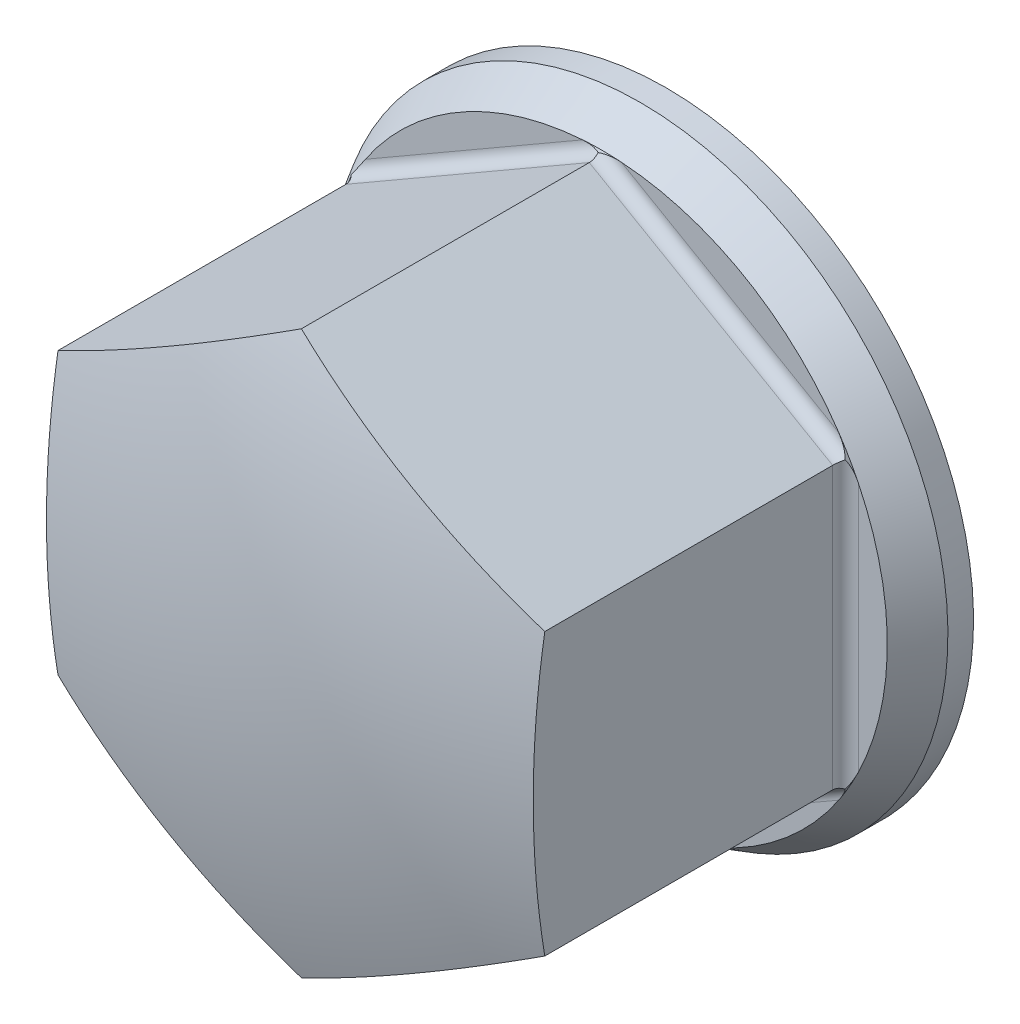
ISO-10303-21;
HEADER;
FILE_DESCRIPTION(('STEP AP214'),'2;1');
FILE_NAME('part.step','',(''),(''),'','','');
FILE_SCHEMA(('AUTOMOTIVE_DESIGN { 1 0 10303 214 1 1 1 1 }'));
ENDSEC;
DATA;
#1=APPLICATION_CONTEXT('core data for automotive mechanical design processes');
#2=APPLICATION_PROTOCOL_DEFINITION('international standard','automotive_design',2000,#1);
#3=PRODUCT_CONTEXT('',#1,'mechanical');
#4=PRODUCT('Part','Part','',(#3));
#5=PRODUCT_RELATED_PRODUCT_CATEGORY('part','',(#4));
#6=PRODUCT_DEFINITION_FORMATION('','',#4);
#7=PRODUCT_DEFINITION_CONTEXT('part definition',#1,'design');
#8=PRODUCT_DEFINITION('design','',#6,#7);
#9=PRODUCT_DEFINITION_SHAPE('','',#8);
#10=(LENGTH_UNIT() NAMED_UNIT(*) SI_UNIT(.MILLI.,.METRE.));
#11=(NAMED_UNIT(*) PLANE_ANGLE_UNIT() SI_UNIT($,.RADIAN.));
#12=(NAMED_UNIT(*) SI_UNIT($,.STERADIAN.) SOLID_ANGLE_UNIT());
#13=UNCERTAINTY_MEASURE_WITH_UNIT(LENGTH_MEASURE(1.E-05),#10,'distance_accuracy_value','');
#14=(GEOMETRIC_REPRESENTATION_CONTEXT(3) GLOBAL_UNCERTAINTY_ASSIGNED_CONTEXT((#13)) GLOBAL_UNIT_ASSIGNED_CONTEXT((#10,
#11,#12)) REPRESENTATION_CONTEXT('',''));
#15=CARTESIAN_POINT('',(0.,0.,0.));
#16=DIRECTION('',(0.,0.,1.));
#17=DIRECTION('',(1.,0.,0.));
#18=AXIS2_PLACEMENT_3D('',#15,#16,#17);
#19=CARTESIAN_POINT('',(0.,0.,0.));
#20=DIRECTION('',(0.,0.,-1.));
#21=DIRECTION('',(0.,1.,0.));
#22=AXIS2_PLACEMENT_3D('',#19,#20,#21);
#23=CYLINDRICAL_SURFACE('',#22,12.);
#24=CARTESIAN_POINT('',(0.,0.,0.));
#25=DIRECTION('',(0.,0.,-1.));
#26=DIRECTION('',(0.,1.,0.));
#27=AXIS2_PLACEMENT_3D('',#24,#25,#26);
#28=CIRCLE('',#27,12.);
#29=CARTESIAN_POINT('',(0.,12.,0.));
#30=VERTEX_POINT('',#29);
#31=EDGE_CURVE('E175',#30,#30,#28,.T.);
#32=ORIENTED_EDGE('',*,*,#31,.F.);
#33=EDGE_LOOP('',(#32));
#34=FACE_BOUND('',#33,.T.);
#35=CARTESIAN_POINT('',(0.,0.,1.));
#36=DIRECTION('',(0.,0.,-1.));
#37=DIRECTION('',(0.,1.,0.));
#38=AXIS2_PLACEMENT_3D('',#35,#36,#37);
#39=CIRCLE('',#38,12.);
#40=CARTESIAN_POINT('',(0.,12.,1.));
#41=VERTEX_POINT('',#40);
#42=EDGE_CURVE('E140',#41,#41,#39,.T.);
#43=ORIENTED_EDGE('',*,*,#42,.T.);
#44=EDGE_LOOP('',(#43));
#45=FACE_BOUND('',#44,.T.);
#46=ADVANCED_FACE('F14',(#34,#45),#23,.T.);
#47=CARTESIAN_POINT('',(12.,0.,0.));
#48=DIRECTION('',(0.,0.,1.));
#49=DIRECTION('',(0.,-1.,0.));
#50=AXIS2_PLACEMENT_3D('',#47,#48,#49);
#51=PLANE('',#50);
#52=CARTESIAN_POINT('',(0.,0.,0.));
#53=DIRECTION('',(0.,0.,-1.));
#54=DIRECTION('',(0.,1.,0.));
#55=AXIS2_PLACEMENT_3D('',#52,#53,#54);
#56=CIRCLE('',#55,6.);
#57=CARTESIAN_POINT('',(0.,6.,0.));
#58=VERTEX_POINT('',#57);
#59=EDGE_CURVE('E323',#58,#58,#56,.T.);
#60=ORIENTED_EDGE('',*,*,#59,.F.);
#61=EDGE_LOOP('',(#60));
#62=FACE_BOUND('',#61,.T.);
#63=ORIENTED_EDGE('',*,*,#31,.T.);
#64=EDGE_LOOP('',(#63));
#65=FACE_BOUND('',#64,.T.);
#66=ADVANCED_FACE('F307',(#62,#65),#51,.F.);
#67=CARTESIAN_POINT('',(0.,0.,1.));
#68=DIRECTION('',(0.,0.,-1.));
#69=DIRECTION('',(0.,1.,0.));
#70=AXIS2_PLACEMENT_3D('',#67,#68,#69);
#71=CYLINDRICAL_SURFACE('',#70,11.1339745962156);
#72=CARTESIAN_POINT('',(-9.5,-5.80649552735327,3.));
#73=CARTESIAN_POINT('',(-9.49997954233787,-5.80652729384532,2.98433882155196));
#74=CARTESIAN_POINT('',(-9.50073467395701,-5.80529359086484,2.9687192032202));
#75=CARTESIAN_POINT('',(-9.5036170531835,-5.80057460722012,2.93808940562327));
#76=CARTESIAN_POINT('',(-9.50573215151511,-5.7971092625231,2.92307506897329));
#77=CARTESIAN_POINT('',(-9.51115280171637,-5.78821110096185,2.89393642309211));
#78=CARTESIAN_POINT('',(-9.51445475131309,-5.7827842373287,2.87980957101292));
#79=CARTESIAN_POINT('',(-9.5220274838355,-5.7703064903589,2.85254604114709));
#80=CARTESIAN_POINT('',(-9.526300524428,-5.76325182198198,2.83941176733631));
#81=CARTESIAN_POINT('',(-9.53882878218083,-5.74250508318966,2.80547647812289));
#82=CARTESIAN_POINT('',(-9.54779029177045,-5.72760328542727,2.78567682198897));
#83=CARTESIAN_POINT('',(-9.56707894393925,-5.695326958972,2.74898079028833));
#84=CARTESIAN_POINT('',(-9.57740988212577,-5.67794554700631,2.73209279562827));
#85=CARTESIAN_POINT('',(-9.60675156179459,-5.62823581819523,2.68945845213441));
#86=CARTESIAN_POINT('',(-9.62659679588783,-5.59425296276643,2.66623624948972));
#87=CARTESIAN_POINT('',(-9.66732473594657,-5.52357745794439,2.62563015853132));
#88=CARTESIAN_POINT('',(-9.68821006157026,-5.48687783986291,2.60826196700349));
#89=CARTESIAN_POINT('',(-9.72963925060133,-5.41306213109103,2.57865660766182));
#90=CARTESIAN_POINT('',(-9.75017213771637,-5.37599837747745,2.56627097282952));
#91=CARTESIAN_POINT('',(-9.79123466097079,-5.30084486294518,2.5450827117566));
#92=CARTESIAN_POINT('',(-9.81176427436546,-5.26275413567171,2.53628359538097));
#93=CARTESIAN_POINT('',(-9.87302770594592,-5.14745194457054,2.51444151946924));
#94=CARTESIAN_POINT('',(-9.913451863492,-5.06918248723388,2.50594374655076));
#95=CARTESIAN_POINT('',(-9.96088366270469,-4.97458577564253,2.50147038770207));
#96=CARTESIAN_POINT('',(-9.96876859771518,-4.95876574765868,2.50091509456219));
#97=CARTESIAN_POINT('',(-9.98444726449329,-4.92712005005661,2.50017988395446));
#98=CARTESIAN_POINT('',(-9.99224117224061,-4.91129448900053,2.49999905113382));
#99=CARTESIAN_POINT('',(-10.,-4.89544587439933,2.5));
#100=B_SPLINE_CURVE_WITH_KNOTS('',3,(#72,#73,#74,#75,#76,#77,#78,#79,#80,#81,#82,#83,#84,#85,
#86,#87,#88,#89,#90,#91,#92,#93,#94,#95,#96,#97,#98,#99),.UNSPECIFIED.,.F.,.F.,(4,2,2,2,2,2,2,2,
2,2,2,2,2,4),(0.,0.0468508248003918,0.0932888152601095,0.139587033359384,0.185994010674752,
0.264590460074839,0.343409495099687,0.479722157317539,0.616397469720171,0.748628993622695,
0.880989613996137,1.14561083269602,1.19866671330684,1.2515927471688),.UNSPECIFIED.);
#101=CARTESIAN_POINT('',(-9.64230484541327,-5.56698729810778,2.6506374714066));
#102=VERTEX_POINT('',#101);
#103=CARTESIAN_POINT('',(-10.,-4.89544587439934,2.5));
#104=VERTEX_POINT('',#103);
#105=EDGE_CURVE('E270',#102,#104,#100,.T.);
#106=ORIENTED_EDGE('',*,*,#105,.T.);
#107=CARTESIAN_POINT('',(0.,0.,2.5));
#108=DIRECTION('',(0.,0.,-1.));
#109=DIRECTION('',(0.,1.,0.));
#110=AXIS2_PLACEMENT_3D('',#107,#108,#109);
#111=CIRCLE('',#110,11.1339745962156);
#112=CARTESIAN_POINT('',(-9.23958049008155,-6.21253110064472,2.5));
#113=VERTEX_POINT('',#112);
#114=EDGE_CURVE('E569',#113,#104,#111,.T.);
#115=ORIENTED_EDGE('',*,*,#114,.F.);
#116=CARTESIAN_POINT('',(-9.23958049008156,-6.21253110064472,2.5));
#117=CARTESIAN_POINT('',(-9.25538522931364,-6.18902561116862,2.50000180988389));
#118=CARTESIAN_POINT('',(-9.27109903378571,-6.16546137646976,2.50046507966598));
#119=CARTESIAN_POINT('',(-9.3023332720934,-6.11823406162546,2.50237335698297));
#120=CARTESIAN_POINT('',(-9.31785364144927,-6.09457095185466,2.50381868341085));
#121=CARTESIAN_POINT('',(-9.36433905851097,-6.02310446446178,2.50974711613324));
#122=CARTESIAN_POINT('',(-9.39497443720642,-5.97520165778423,2.51582466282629));
#123=CARTESIAN_POINT('',(-9.45561653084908,-5.87877583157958,2.53306733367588));
#124=CARTESIAN_POINT('',(-9.48560469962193,-5.83025552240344,2.54431424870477));
#125=CARTESIAN_POINT('',(-9.54395150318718,-5.73423980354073,2.57305937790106));
#126=CARTESIAN_POINT('',(-9.57231597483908,-5.68674116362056,2.59053332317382));
#127=CARTESIAN_POINT('',(-9.61305359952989,-5.61741152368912,2.62280833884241));
#128=CARTESIAN_POINT('',(-9.62630420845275,-5.5946691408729,2.63454503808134));
#129=CARTESIAN_POINT('',(-9.65205712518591,-5.55012092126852,2.66039532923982));
#130=CARTESIAN_POINT('',(-9.66455977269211,-5.52831466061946,2.67450783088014));
#131=CARTESIAN_POINT('',(-9.6886666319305,-5.48595739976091,2.70567640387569));
#132=CARTESIAN_POINT('',(-9.70026134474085,-5.46542005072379,2.72275877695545));
#133=CARTESIAN_POINT('',(-9.72195485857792,-5.42673671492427,2.76027770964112));
#134=CARTESIAN_POINT('',(-9.73205731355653,-5.40858489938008,2.78070580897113));
#135=CARTESIAN_POINT('',(-9.74648722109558,-5.38251857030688,2.81653953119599));
#136=CARTESIAN_POINT('',(-9.75152440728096,-5.37338344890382,2.83076629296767));
#137=CARTESIAN_POINT('',(-9.76053012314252,-5.35700746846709,2.86060196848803));
#138=CARTESIAN_POINT('',(-9.76449934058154,-5.34976539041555,2.87620998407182));
#139=CARTESIAN_POINT('',(-9.77070621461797,-5.33841994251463,2.9067166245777));
#140=CARTESIAN_POINT('',(-9.77309230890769,-5.33404815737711,2.92148392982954));
#141=CARTESIAN_POINT('',(-9.77663298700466,-5.32755594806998,2.95163038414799));
#142=CARTESIAN_POINT('',(-9.77779072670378,-5.32542975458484,2.96700785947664));
#143=CARTESIAN_POINT('',(-9.77847934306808,-5.32416485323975,2.98830152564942));
#144=CARTESIAN_POINT('',(-9.77857424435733,-5.32399047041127,2.9941519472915));
#145=CARTESIAN_POINT('',(-9.77857263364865,-5.32399357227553,3.));
#146=B_SPLINE_CURVE_WITH_KNOTS('',3,(#116,#117,#118,#119,#120,#121,#122,#123,#124,#125,#126,
#127,#128,#129,#130,#131,#132,#133,#134,#135,#136,#137,#138,#139,#140,#141,#142,#143,#144,#145),
.UNSPECIFIED.,.F.,.F.,(4,2,2,2,2,2,2,2,2,2,2,2,2,2,4),(0.,0.0849655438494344,0.169958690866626,
0.341307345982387,0.51546574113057,0.688952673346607,0.775318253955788,0.861644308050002,
0.948777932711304,1.03569453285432,1.08847186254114,1.14121512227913,1.1877756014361,
1.23421616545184,1.25176402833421),.UNSPECIFIED.);
#147=EDGE_CURVE('E265',#113,#102,#146,.T.);
#148=ORIENTED_EDGE('',*,*,#147,.T.);
#149=EDGE_LOOP('',(#106,#115,#148));
#150=FACE_BOUND('',#149,.T.);
#151=ADVANCED_FACE('F199',(#150),#71,.T.);
#152=CARTESIAN_POINT('',(9.5,5.80649552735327,3.));
#153=CARTESIAN_POINT('',(9.49997954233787,5.80652729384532,2.98433882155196));
#154=CARTESIAN_POINT('',(9.50073467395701,5.80529359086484,2.9687192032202));
#155=CARTESIAN_POINT('',(9.5036170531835,5.80057460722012,2.93808940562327));
#156=CARTESIAN_POINT('',(9.50573215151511,5.7971092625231,2.92307506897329));
#157=CARTESIAN_POINT('',(9.51115280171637,5.78821110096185,2.89393642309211));
#158=CARTESIAN_POINT('',(9.51445475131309,5.78278423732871,2.87980957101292));
#159=CARTESIAN_POINT('',(9.5220274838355,5.7703064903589,2.85254604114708));
#160=CARTESIAN_POINT('',(9.526300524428,5.76325182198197,2.83941176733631));
#161=CARTESIAN_POINT('',(9.53882878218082,5.74250508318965,2.80547647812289));
#162=CARTESIAN_POINT('',(9.54779029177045,5.72760328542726,2.78567682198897));
#163=CARTESIAN_POINT('',(9.56707894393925,5.695326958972,2.74898079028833));
#164=CARTESIAN_POINT('',(9.57740988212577,5.67794554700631,2.73209279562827));
#165=CARTESIAN_POINT('',(9.60675156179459,5.62823581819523,2.68945845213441));
#166=CARTESIAN_POINT('',(9.62659679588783,5.59425296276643,2.66623624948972));
#167=CARTESIAN_POINT('',(9.66732473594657,5.5235774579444,2.62563015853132));
#168=CARTESIAN_POINT('',(9.68821006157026,5.48687783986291,2.60826196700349));
#169=CARTESIAN_POINT('',(9.72963925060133,5.41306213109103,2.57865660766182));
#170=CARTESIAN_POINT('',(9.75017213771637,5.37599837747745,2.56627097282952));
#171=CARTESIAN_POINT('',(9.79123466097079,5.30084486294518,2.5450827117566));
#172=CARTESIAN_POINT('',(9.81176427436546,5.26275413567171,2.53628359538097));
#173=CARTESIAN_POINT('',(9.87302770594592,5.14745194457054,2.51444151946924));
#174=CARTESIAN_POINT('',(9.913451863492,5.06918248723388,2.50594374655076));
#175=CARTESIAN_POINT('',(9.96088366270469,4.97458577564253,2.50147038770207));
#176=CARTESIAN_POINT('',(9.96876859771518,4.95876574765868,2.50091509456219));
#177=CARTESIAN_POINT('',(9.98444726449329,4.9271200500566,2.50017988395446));
#178=CARTESIAN_POINT('',(9.99224117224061,4.91129448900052,2.49999905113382));
#179=CARTESIAN_POINT('',(10.,4.89544587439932,2.5));
#180=B_SPLINE_CURVE_WITH_KNOTS('',3,(#152,#153,#154,#155,#156,#157,#158,#159,#160,#161,#162,
#163,#164,#165,#166,#167,#168,#169,#170,#171,#172,#173,#174,#175,#176,#177,#178,#179),
.UNSPECIFIED.,.F.,.F.,(4,2,2,2,2,2,2,2,2,2,2,2,2,4),(0.,0.0468508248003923,0.0932888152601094,
0.139587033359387,0.185994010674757,0.264590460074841,0.343409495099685,0.479722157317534,
0.61639746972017,0.748628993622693,0.880989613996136,1.14561083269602,1.19866671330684,
1.25159274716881),.UNSPECIFIED.);
#181=CARTESIAN_POINT('',(9.64230484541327,5.56698729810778,2.6506374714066));
#182=VERTEX_POINT('',#181);
#183=CARTESIAN_POINT('',(10.,4.89544587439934,2.5));
#184=VERTEX_POINT('',#183);
#185=EDGE_CURVE('E259',#182,#184,#180,.T.);
#186=ORIENTED_EDGE('',*,*,#185,.T.);
#187=CARTESIAN_POINT('',(9.23958049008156,6.21253110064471,2.5));
#188=VERTEX_POINT('',#187);
#189=EDGE_CURVE('E136',#188,#184,#111,.T.);
#190=ORIENTED_EDGE('',*,*,#189,.F.);
#191=CARTESIAN_POINT('',(9.23958049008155,6.21253110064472,2.5));
#192=CARTESIAN_POINT('',(9.25538522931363,6.18902561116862,2.50000180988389));
#193=CARTESIAN_POINT('',(9.27109903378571,6.16546137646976,2.50046507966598));
#194=CARTESIAN_POINT('',(9.3023332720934,6.11823406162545,2.50237335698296));
#195=CARTESIAN_POINT('',(9.31785364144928,6.09457095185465,2.50381868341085));
#196=CARTESIAN_POINT('',(9.36433905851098,6.02310446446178,2.50974711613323));
#197=CARTESIAN_POINT('',(9.39497443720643,5.97520165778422,2.51582466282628));
#198=CARTESIAN_POINT('',(9.45561653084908,5.87877583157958,2.53306733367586));
#199=CARTESIAN_POINT('',(9.48560469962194,5.83025552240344,2.54431424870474));
#200=CARTESIAN_POINT('',(9.54395150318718,5.73423980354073,2.57305937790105));
#201=CARTESIAN_POINT('',(9.57231597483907,5.68674116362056,2.59053332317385));
#202=CARTESIAN_POINT('',(9.61305359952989,5.61741152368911,2.6228083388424));
#203=CARTESIAN_POINT('',(9.62630420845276,5.59466914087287,2.6345450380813));
#204=CARTESIAN_POINT('',(9.65205712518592,5.5501209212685,2.66039532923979));
#205=CARTESIAN_POINT('',(9.66455977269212,5.52831466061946,2.67450783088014));
#206=CARTESIAN_POINT('',(9.68866663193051,5.48595739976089,2.70567640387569));
#207=CARTESIAN_POINT('',(9.70026134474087,5.46542005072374,2.72275877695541));
#208=CARTESIAN_POINT('',(9.72195485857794,5.42673671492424,2.76027770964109));
#209=CARTESIAN_POINT('',(9.73205731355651,5.4085848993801,2.78070580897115));
#210=CARTESIAN_POINT('',(9.74648722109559,5.38251857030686,2.81653953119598));
#211=CARTESIAN_POINT('',(9.751524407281,5.37338344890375,2.83076629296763));
#212=CARTESIAN_POINT('',(9.76053012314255,5.35700746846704,2.860601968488));
#213=CARTESIAN_POINT('',(9.76449934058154,5.34976539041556,2.87620998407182));
#214=CARTESIAN_POINT('',(9.77070621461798,5.33841994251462,2.90671662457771));
#215=CARTESIAN_POINT('',(9.77309230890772,5.33404815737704,2.92148392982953));
#216=CARTESIAN_POINT('',(9.7766329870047,5.3275559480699,2.95163038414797));
#217=CARTESIAN_POINT('',(9.77779072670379,5.32542975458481,2.96700785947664));
#218=CARTESIAN_POINT('',(9.77847934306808,5.32416485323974,2.98830152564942));
#219=CARTESIAN_POINT('',(9.77857424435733,5.32399047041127,2.99415194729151));
#220=CARTESIAN_POINT('',(9.77857263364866,5.32399357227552,3.));
#221=B_SPLINE_CURVE_WITH_KNOTS('',3,(#191,#192,#193,#194,#195,#196,#197,#198,#199,#200,#201,
#202,#203,#204,#205,#206,#207,#208,#209,#210,#211,#212,#213,#214,#215,#216,#217,#218,#219,#220),
.UNSPECIFIED.,.F.,.F.,(4,2,2,2,2,2,2,2,2,2,2,2,2,2,4),(0.,0.084965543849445,0.169958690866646,
0.341307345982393,0.515465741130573,0.688952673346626,0.775318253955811,0.861644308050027,
0.948777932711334,1.03569453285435,1.08847186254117,1.14121512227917,1.18777560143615,
1.23421616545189,1.25176402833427),.UNSPECIFIED.);
#222=EDGE_CURVE('E253',#188,#182,#221,.T.);
#223=ORIENTED_EDGE('',*,*,#222,.T.);
#224=EDGE_LOOP('',(#186,#190,#223));
#225=FACE_BOUND('',#224,.T.);
#226=ADVANCED_FACE('F479',(#225),#71,.T.);
#227=CARTESIAN_POINT('',(-10.,4.89544587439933,2.5));
#228=CARTESIAN_POINT('',(-9.98754601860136,4.92088592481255,2.50000180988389));
#229=CARTESIAN_POINT('',(-9.97499569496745,4.9462765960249,2.50046507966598));
#230=CARTESIAN_POINT('',(-9.94971275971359,4.99693989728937,2.50237335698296));
#231=CARTESIAN_POINT('',(-9.93698009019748,5.02221248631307,2.50381868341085));
#232=CARTESIAN_POINT('',(-9.89833100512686,5.09820328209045,2.50974711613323));
#233=CARTESIAN_POINT('',(-9.87216364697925,5.14868570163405,2.51582466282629));
#234=CARTESIAN_POINT('',(-9.81897747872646,5.24941620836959,2.53306733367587));
#235=CARTESIAN_POINT('',(-9.79195174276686,5.29964687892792,2.54431424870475));
#236=CARTESIAN_POINT('',(-9.73797309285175,5.3981845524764,2.57305937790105));
#237=CARTESIAN_POINT('',(-9.71102029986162,5.44649822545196,2.59053332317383));
#238=CARTESIAN_POINT('',(-9.67134788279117,5.51644286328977,2.6228083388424));
#239=CARTESIAN_POINT('',(-9.65827770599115,5.53928941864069,2.63454503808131));
#240=CARTESIAN_POINT('',(-9.63257427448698,5.58386620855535,2.6603953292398));
#241=CARTESIAN_POINT('',(-9.61994082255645,5.6055969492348,2.67450783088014));
#242=CARTESIAN_POINT('',(-9.59531178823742,5.64765273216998,2.70567640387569));
#243=CARTESIAN_POINT('',(-9.58332327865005,5.6679627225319,2.72275877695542));
#244=CARTESIAN_POINT('',(-9.56066928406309,5.7060915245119,2.7602777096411));
#245=CARTESIAN_POINT('',(-9.55000057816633,5.72391641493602,2.78070580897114));
#246=CARTESIAN_POINT('',(-9.53464142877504,5.74944624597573,2.81653953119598));
#247=CARTESIAN_POINT('',(-9.52924877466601,5.75837613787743,2.83076629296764));
#248=CARTESIAN_POINT('',(-9.51956961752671,5.77436330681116,2.860601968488));
#249=CARTESIAN_POINT('',(-9.51528240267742,5.78142178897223,2.87620998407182));
#250=CARTESIAN_POINT('',(-9.50856039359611,5.79246982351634,2.9067166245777));
#251=CARTESIAN_POINT('',(-9.50596736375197,5.79672213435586,2.92148392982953));
#252=CARTESIAN_POINT('',(-9.50211528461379,5.80303455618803,2.95163038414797));
#253=CARTESIAN_POINT('',(-9.50085281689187,5.80510028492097,2.96700785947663));
#254=CARTESIAN_POINT('',(-9.50010168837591,5.80632909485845,2.98830152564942));
#255=CARTESIAN_POINT('',(-9.49999811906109,5.80649847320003,2.99415194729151));
#256=CARTESIAN_POINT('',(-9.5,5.80649552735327,3.));
#257=B_SPLINE_CURVE_WITH_KNOTS('',3,(#227,#228,#229,#230,#231,#232,#233,#234,#235,#236,#237,
#238,#239,#240,#241,#242,#243,#244,#245,#246,#247,#248,#249,#250,#251,#252,#253,#254,#255,#256),
.UNSPECIFIED.,.F.,.F.,(4,2,2,2,2,2,2,2,2,2,2,2,2,2,4),(0.,0.0849655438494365,0.16995869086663,
0.341307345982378,0.515465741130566,0.68895267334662,0.775318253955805,0.861644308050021,
0.948777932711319,1.03569453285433,1.08847186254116,1.14121512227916,1.18777560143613,
1.23421616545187,1.25176402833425),.UNSPECIFIED.);
#258=CARTESIAN_POINT('',(-10.,4.89544587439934,2.5));
#259=VERTEX_POINT('',#258);
#260=CARTESIAN_POINT('',(-9.64230484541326,5.56698729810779,2.6506374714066));
#261=VERTEX_POINT('',#260);
#262=EDGE_CURVE('E245',#259,#261,#257,.T.);
#263=ORIENTED_EDGE('',*,*,#262,.T.);
#264=CARTESIAN_POINT('',(-9.77857263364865,5.32399357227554,3.));
#265=CARTESIAN_POINT('',(-9.77858991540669,5.3239599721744,2.98433882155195));
#266=CARTESIAN_POINT('',(-9.77789906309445,5.32523078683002,2.9687192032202));
#267=CARTESIAN_POINT('',(-9.77525349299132,5.33008649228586,2.93808940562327));
#268=CARTESIAN_POINT('',(-9.77330996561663,5.33365089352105,2.92307506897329));
#269=CARTESIAN_POINT('',(-9.76831425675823,5.342794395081,2.8939364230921));
#270=CARTESIAN_POINT('',(-9.76526542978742,5.34836739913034,2.87980957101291));
#271=CARTESIAN_POINT('',(-9.75824575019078,5.36116445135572,2.85254604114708));
#272=CARTESIAN_POINT('',(-9.75427274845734,5.36839234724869,2.8394117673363));
#273=CARTESIAN_POINT('',(-9.74256967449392,5.38961550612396,2.80547647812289));
#274=CARTESIAN_POINT('',(-9.73414509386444,5.40482729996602,2.78567682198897));
#275=CARTESIAN_POINT('',(-9.71583730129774,5.43766992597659,2.74898079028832));
#276=CARTESIAN_POINT('',(-9.70595002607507,5.4553074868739,2.73209279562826));
#277=CARTESIAN_POINT('',(-9.67757097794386,5.50557299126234,2.68945845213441));
#278=CARTESIAN_POINT('',(-9.658063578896,5.53975089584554,2.66623624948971));
#279=CARTESIAN_POINT('',(-9.61722076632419,5.61036007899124,2.62563015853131));
#280=CARTESIAN_POINT('',(-9.59588062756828,5.64679711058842,2.60826196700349));
#281=CARTESIAN_POINT('',(-9.55266894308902,5.71958369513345,2.57865660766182));
#282=CARTESIAN_POINT('',(-9.53083723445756,5.7558975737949,2.56627097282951));
#283=CARTESIAN_POINT('',(-9.48628364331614,5.82903551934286,2.54508271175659));
#284=CARTESIAN_POINT('',(-9.46356091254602,5.86586004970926,2.53628359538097));
#285=CARTESIAN_POINT('',(-9.39433800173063,5.97656683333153,2.51444151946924));
#286=CARTESIAN_POINT('',(-9.34676674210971,6.05070990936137,2.50594374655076));
#287=CARTESIAN_POINT('',(-9.28855948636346,6.13908540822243,2.50147038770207));
#288=CARTESIAN_POINT('',(-9.27880140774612,6.15382397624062,2.50091509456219));
#289=CARTESIAN_POINT('',(-9.2592347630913,6.18322494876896,2.50017988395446));
#290=CARTESIAN_POINT('',(-9.24942637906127,6.19788745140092,2.49999905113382));
#291=CARTESIAN_POINT('',(-9.23958049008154,6.21253110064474,2.5));
#292=B_SPLINE_CURVE_WITH_KNOTS('',3,(#264,#265,#266,#267,#268,#269,#270,#271,#272,#273,#274,
#275,#276,#277,#278,#279,#280,#281,#282,#283,#284,#285,#286,#287,#288,#289,#290,#291),
.UNSPECIFIED.,.F.,.F.,(4,2,2,2,2,2,2,2,2,2,2,2,2,4),(0.,0.0468508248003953,0.0932888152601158,
0.139587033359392,0.185994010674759,0.264590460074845,0.343409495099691,0.479722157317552,
0.616397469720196,0.748628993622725,0.880989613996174,1.14561083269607,1.19866671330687,
1.25159274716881),.UNSPECIFIED.);
#293=CARTESIAN_POINT('',(-9.23958049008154,6.21253110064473,2.5));
#294=VERTEX_POINT('',#293);
#295=EDGE_CURVE('E238',#261,#294,#292,.T.);
#296=ORIENTED_EDGE('',*,*,#295,.T.);
#297=EDGE_CURVE('E583',#259,#294,#111,.T.);
#298=ORIENTED_EDGE('',*,*,#297,.F.);
#299=EDGE_LOOP('',(#263,#296,#298));
#300=FACE_BOUND('',#299,.T.);
#301=ADVANCED_FACE('F472',(#300),#71,.T.);
#302=CARTESIAN_POINT('',(-0.278572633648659,11.1304890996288,3.));
#303=CARTESIAN_POINT('',(-0.278610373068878,11.1304872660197,2.98433882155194));
#304=CARTESIAN_POINT('',(-0.277164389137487,11.1305243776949,2.9687192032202));
#305=CARTESIAN_POINT('',(-0.271636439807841,11.130661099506,2.93808940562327));
#306=CARTESIAN_POINT('',(-0.26757781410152,11.1307601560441,2.9230750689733));
#307=CARTESIAN_POINT('',(-0.257161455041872,11.1310054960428,2.8939364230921));
#308=CARTESIAN_POINT('',(-0.250810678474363,11.131151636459,2.8798095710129));
#309=CARTESIAN_POINT('',(-0.236218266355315,11.1314709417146,2.85254604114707));
#310=CARTESIAN_POINT('',(-0.227972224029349,11.1316441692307,2.8394117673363));
#311=CARTESIAN_POINT('',(-0.203740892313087,11.1321205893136,2.8054764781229));
#312=CARTESIAN_POINT('',(-0.186354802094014,11.1324305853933,2.78567682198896));
#313=CARTESIAN_POINT('',(-0.148758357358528,11.1329968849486,2.74898079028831));
#314=CARTESIAN_POINT('',(-0.128540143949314,11.1332530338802,2.73209279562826));
#315=CARTESIAN_POINT('',(-0.0708194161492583,11.1338088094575,2.68945845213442));
#316=CARTESIAN_POINT('',(-0.0314667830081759,11.134003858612,2.6662362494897));
#317=CARTESIAN_POINT('',(0.0501039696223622,11.1339375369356,2.6256301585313));
#318=CARTESIAN_POINT('',(0.0923294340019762,11.1336749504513,2.60826196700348));
#319=CARTESIAN_POINT('',(0.176970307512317,11.1326458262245,2.57865660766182));
#320=CARTESIAN_POINT('',(0.219334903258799,11.1318959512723,2.56627097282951));
#321=CARTESIAN_POINT('',(0.304951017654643,11.129880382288,2.54508271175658));
#322=CARTESIAN_POINT('',(0.348203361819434,11.1286141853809,2.53628359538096));
#323=CARTESIAN_POINT('',(0.478689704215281,11.124018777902,2.51444151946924));
#324=CARTESIAN_POINT('',(0.566685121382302,11.1198923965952,2.50594374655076));
#325=CARTESIAN_POINT('',(0.672324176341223,11.1136711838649,2.50147038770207));
#326=CARTESIAN_POINT('',(0.689967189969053,11.1125897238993,2.50091509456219));
#327=CARTESIAN_POINT('',(0.72521250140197,11.1103449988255,2.50017988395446));
#328=CARTESIAN_POINT('',(0.74281479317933,11.1091819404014,2.49999905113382));
#329=CARTESIAN_POINT('',(0.760419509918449,11.1079769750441,2.5));
#330=B_SPLINE_CURVE_WITH_KNOTS('',3,(#302,#303,#304,#305,#306,#307,#308,#309,#310,#311,#312,
#313,#314,#315,#316,#317,#318,#319,#320,#321,#322,#323,#324,#325,#326,#327,#328,#329),
.UNSPECIFIED.,.F.,.F.,(4,2,2,2,2,2,2,2,2,2,2,2,2,4),(0.,0.0468508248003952,0.0932888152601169,
0.139587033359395,0.185994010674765,0.264590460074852,0.3434094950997,0.479722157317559,
0.616397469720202,0.74862899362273,0.880989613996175,1.14561083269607,1.19866671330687,
1.25159274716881),.UNSPECIFIED.);
#331=CARTESIAN_POINT('',(0.,11.1339745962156,2.6506374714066));
#332=VERTEX_POINT('',#331);
#333=CARTESIAN_POINT('',(0.760419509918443,11.1079769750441,2.5));
#334=VERTEX_POINT('',#333);
#335=EDGE_CURVE('E231',#332,#334,#330,.T.);
#336=ORIENTED_EDGE('',*,*,#335,.T.);
#337=CARTESIAN_POINT('',(-0.760419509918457,11.1079769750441,2.5));
#338=VERTEX_POINT('',#337);
#339=EDGE_CURVE('E649',#338,#334,#111,.T.);
#340=ORIENTED_EDGE('',*,*,#339,.F.);
#341=CARTESIAN_POINT('',(-0.760419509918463,11.1079769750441,2.5));
#342=CARTESIAN_POINT('',(-0.732160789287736,11.1099115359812,2.50000180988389));
#343=CARTESIAN_POINT('',(-0.703896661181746,11.1117379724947,2.50046507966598));
#344=CARTESIAN_POINT('',(-0.647379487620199,11.1151739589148,2.50237335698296));
#345=CARTESIAN_POINT('',(-0.619126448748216,11.1167834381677,2.50381868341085));
#346=CARTESIAN_POINT('',(-0.533991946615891,11.1213077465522,2.50974711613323));
#347=CARTESIAN_POINT('',(-0.477189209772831,11.1238873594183,2.51582466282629));
#348=CARTESIAN_POINT('',(-0.363360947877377,11.1281920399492,2.53306733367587));
#349=CARTESIAN_POINT('',(-0.306347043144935,11.1299024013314,2.54431424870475));
#350=CARTESIAN_POINT('',(-0.194021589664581,11.1324243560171,2.57305937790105));
#351=CARTESIAN_POINT('',(-0.138704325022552,11.1332393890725,2.59053332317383));
#352=CARTESIAN_POINT('',(-0.0582942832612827,11.1338543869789,2.6228083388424));
#353=CARTESIAN_POINT('',(-0.0319734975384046,11.1339585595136,2.63454503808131));
#354=CARTESIAN_POINT('',(0.0194828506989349,11.1339871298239,2.6603953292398));
#355=CARTESIAN_POINT('',(0.0446189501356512,11.1339116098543,2.67450783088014));
#356=CARTESIAN_POINT('',(0.0933548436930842,11.1336101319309,2.70567640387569));
#357=CARTESIAN_POINT('',(0.116938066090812,11.1333827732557,2.72275877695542));
#358=CARTESIAN_POINT('',(0.161285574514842,11.1328282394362,2.7602777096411));
#359=CARTESIAN_POINT('',(0.182056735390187,11.1325013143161,2.78070580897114));
#360=CARTESIAN_POINT('',(0.211845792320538,11.1319648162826,2.81653953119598));
#361=CARTESIAN_POINT('',(0.222275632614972,11.1317595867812,2.83076629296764));
#362=CARTESIAN_POINT('',(0.240960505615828,11.1313707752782,2.860601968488));
#363=CARTESIAN_POINT('',(0.249216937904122,11.1311871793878,2.87620998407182));
#364=CARTESIAN_POINT('',(0.262145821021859,11.130889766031,2.9067166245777));
#365=CARTESIAN_POINT('',(0.267124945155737,11.1307702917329,2.92148392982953));
#366=CARTESIAN_POINT('',(0.274517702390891,11.130590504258,2.95163038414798));
#367=CARTESIAN_POINT('',(0.276937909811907,11.1305300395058,2.96700785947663));
#368=CARTESIAN_POINT('',(0.278377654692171,11.1304939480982,2.98830152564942));
#369=CARTESIAN_POINT('',(0.278576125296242,11.1304889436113,2.99415194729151));
#370=CARTESIAN_POINT('',(0.27857263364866,11.1304890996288,3.));
#371=B_SPLINE_CURVE_WITH_KNOTS('',3,(#341,#342,#343,#344,#345,#346,#347,#348,#349,#350,#351,
#352,#353,#354,#355,#356,#357,#358,#359,#360,#361,#362,#363,#364,#365,#366,#367,#368,#369,#370),
.UNSPECIFIED.,.F.,.F.,(4,2,2,2,2,2,2,2,2,2,2,2,2,2,4),(0.,0.0849655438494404,0.169958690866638,
0.341307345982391,0.515465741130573,0.688952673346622,0.775318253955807,0.861644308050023,
0.948777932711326,1.03569453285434,1.08847186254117,1.14121512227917,1.18777560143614,
1.23421616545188,1.25176402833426),.UNSPECIFIED.);
#372=EDGE_CURVE('E224',#338,#332,#371,.T.);
#373=ORIENTED_EDGE('',*,*,#372,.T.);
#374=EDGE_LOOP('',(#336,#340,#373));
#375=FACE_BOUND('',#374,.T.);
#376=ADVANCED_FACE('F465',(#375),#71,.T.);
#377=CARTESIAN_POINT('',(0.278572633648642,-11.1304890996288,3.));
#378=CARTESIAN_POINT('',(0.278610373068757,-11.1304872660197,2.98433882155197));
#379=CARTESIAN_POINT('',(0.277164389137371,-11.1305243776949,2.96871920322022));
#380=CARTESIAN_POINT('',(0.271636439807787,-11.130661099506,2.93808940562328));
#381=CARTESIAN_POINT('',(0.267577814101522,-11.1307601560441,2.92307506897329));
#382=CARTESIAN_POINT('',(0.257161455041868,-11.1310054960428,2.89393642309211));
#383=CARTESIAN_POINT('',(0.250810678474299,-11.131151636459,2.87980957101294));
#384=CARTESIAN_POINT('',(0.236218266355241,-11.1314709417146,2.8525460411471));
#385=CARTESIAN_POINT('',(0.227972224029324,-11.1316441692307,2.83941176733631));
#386=CARTESIAN_POINT('',(0.203740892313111,-11.1321205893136,2.80547647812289));
#387=CARTESIAN_POINT('',(0.186354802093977,-11.1324305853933,2.78567682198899));
#388=CARTESIAN_POINT('',(0.148758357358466,-11.1329968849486,2.74898079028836));
#389=CARTESIAN_POINT('',(0.128540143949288,-11.1332530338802,2.73209279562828));
#390=CARTESIAN_POINT('',(0.0708194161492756,-11.1338088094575,2.6894584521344));
#391=CARTESIAN_POINT('',(0.0314667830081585,-11.134003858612,2.66623624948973));
#392=CARTESIAN_POINT('',(-0.0501039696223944,-11.1339375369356,2.62563015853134));
#393=CARTESIAN_POINT('',(-0.0923294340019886,-11.1336749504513,2.60826196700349));
#394=CARTESIAN_POINT('',(-0.176970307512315,-11.1326458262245,2.57865660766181));
#395=CARTESIAN_POINT('',(-0.219334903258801,-11.1318959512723,2.56627097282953));
#396=CARTESIAN_POINT('',(-0.304951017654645,-11.129880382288,2.54508271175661));
#397=CARTESIAN_POINT('',(-0.348203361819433,-11.1286141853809,2.53628359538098));
#398=CARTESIAN_POINT('',(-0.47868970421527,-11.124018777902,2.51444151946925));
#399=CARTESIAN_POINT('',(-0.566685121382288,-11.1198923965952,2.50594374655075));
#400=CARTESIAN_POINT('',(-0.67232417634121,-11.1136711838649,2.50147038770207));
#401=CARTESIAN_POINT('',(-0.689967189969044,-11.1125897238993,2.50091509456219));
#402=CARTESIAN_POINT('',(-0.725212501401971,-11.1103449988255,2.50017988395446));
#403=CARTESIAN_POINT('',(-0.742814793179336,-11.1091819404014,2.49999905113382));
#404=CARTESIAN_POINT('',(-0.76041950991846,-11.1079769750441,2.5));
#405=B_SPLINE_CURVE_WITH_KNOTS('',3,(#377,#378,#379,#380,#381,#382,#383,#384,#385,#386,#387,
#388,#389,#390,#391,#392,#393,#394,#395,#396,#397,#398,#399,#400,#401,#402,#403,#404),
.UNSPECIFIED.,.F.,.F.,(4,2,2,2,2,2,2,2,2,2,2,2,2,4),(0.,0.0468508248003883,0.0932888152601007,
0.139587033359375,0.185994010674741,0.264590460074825,0.34340949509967,0.479722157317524,
0.616397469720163,0.748628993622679,0.880989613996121,1.145610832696,1.19866671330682,
1.25159274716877),.UNSPECIFIED.);
#406=CARTESIAN_POINT('',(0.,-11.1339745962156,2.6506374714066));
#407=VERTEX_POINT('',#406);
#408=CARTESIAN_POINT('',(-0.760419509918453,-11.1079769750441,2.5));
#409=VERTEX_POINT('',#408);
#410=EDGE_CURVE('E151',#407,#409,#405,.T.);
#411=ORIENTED_EDGE('',*,*,#410,.T.);
#412=CARTESIAN_POINT('',(0.76041950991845,-11.1079769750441,2.5));
#413=VERTEX_POINT('',#412);
#414=EDGE_CURVE('E590',#413,#409,#111,.T.);
#415=ORIENTED_EDGE('',*,*,#414,.F.);
#416=CARTESIAN_POINT('',(0.760419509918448,-11.1079769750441,2.5));
#417=CARTESIAN_POINT('',(0.732160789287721,-11.1099115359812,2.50000180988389));
#418=CARTESIAN_POINT('',(0.703896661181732,-11.1117379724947,2.50046507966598));
#419=CARTESIAN_POINT('',(0.647379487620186,-11.1151739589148,2.50237335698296));
#420=CARTESIAN_POINT('',(0.619126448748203,-11.1167834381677,2.50381868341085));
#421=CARTESIAN_POINT('',(0.533991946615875,-11.1213077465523,2.50974711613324));
#422=CARTESIAN_POINT('',(0.477189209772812,-11.1238873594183,2.51582466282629));
#423=CARTESIAN_POINT('',(0.363360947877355,-11.1281920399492,2.53306733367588));
#424=CARTESIAN_POINT('',(0.306347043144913,-11.1299024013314,2.54431424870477));
#425=CARTESIAN_POINT('',(0.194021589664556,-11.1324243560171,2.57305937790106));
#426=CARTESIAN_POINT('',(0.138704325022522,-11.1332393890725,2.59053332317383));
#427=CARTESIAN_POINT('',(0.0582942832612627,-11.1338543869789,2.62280833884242));
#428=CARTESIAN_POINT('',(0.0319734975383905,-11.1339585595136,2.63454503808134));
#429=CARTESIAN_POINT('',(-0.0194828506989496,-11.1339871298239,2.66039532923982));
#430=CARTESIAN_POINT('',(-0.0446189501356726,-11.1339116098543,2.67450783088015));
#431=CARTESIAN_POINT('',(-0.0933548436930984,-11.1336101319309,2.7056764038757));
#432=CARTESIAN_POINT('',(-0.116938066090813,-11.1333827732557,2.72275877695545));
#433=CARTESIAN_POINT('',(-0.161285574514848,-11.1328282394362,2.76027770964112));
#434=CARTESIAN_POINT('',(-0.182056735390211,-11.1325013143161,2.78070580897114));
#435=CARTESIAN_POINT('',(-0.211845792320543,-11.1319648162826,2.816539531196));
#436=CARTESIAN_POINT('',(-0.222275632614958,-11.1317595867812,2.83076629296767));
#437=CARTESIAN_POINT('',(-0.240960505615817,-11.1313707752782,2.86060196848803));
#438=CARTESIAN_POINT('',(-0.249216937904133,-11.1311871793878,2.87620998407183));
#439=CARTESIAN_POINT('',(-0.262145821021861,-11.130889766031,2.90671662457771));
#440=CARTESIAN_POINT('',(-0.267124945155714,-11.1307702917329,2.92148392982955));
#441=CARTESIAN_POINT('',(-0.274517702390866,-11.130590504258,2.951630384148));
#442=CARTESIAN_POINT('',(-0.276937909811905,-11.1305300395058,2.96700785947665));
#443=CARTESIAN_POINT('',(-0.278377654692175,-11.1304939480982,2.98830152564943));
#444=CARTESIAN_POINT('',(-0.278576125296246,-11.1304889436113,2.99415194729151));
#445=CARTESIAN_POINT('',(-0.278572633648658,-11.1304890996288,3.));
#446=B_SPLINE_CURVE_WITH_KNOTS('',3,(#416,#417,#418,#419,#420,#421,#422,#423,#424,#425,#426,
#427,#428,#429,#430,#431,#432,#433,#434,#435,#436,#437,#438,#439,#440,#441,#442,#443,#444,#445),
.UNSPECIFIED.,.F.,.F.,(4,2,2,2,2,2,2,2,2,2,2,2,2,2,4),(0.,0.0849655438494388,0.169958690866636,
0.341307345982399,0.515465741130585,0.688952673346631,0.775318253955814,0.861644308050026,
0.948777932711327,1.03569453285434,1.08847186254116,1.14121512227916,1.18777560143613,
1.23421616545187,1.25176402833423),.UNSPECIFIED.);
#447=EDGE_CURVE('E9',#413,#407,#446,.T.);
#448=ORIENTED_EDGE('',*,*,#447,.T.);
#449=EDGE_LOOP('',(#411,#415,#448));
#450=FACE_BOUND('',#449,.T.);
#451=ADVANCED_FACE('F198',(#450),#71,.T.);
#452=CARTESIAN_POINT('',(10.,-4.89544587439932,2.5));
#453=CARTESIAN_POINT('',(9.98754601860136,-4.92088592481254,2.50000180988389));
#454=CARTESIAN_POINT('',(9.97499569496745,-4.94627659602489,2.50046507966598));
#455=CARTESIAN_POINT('',(9.9497127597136,-4.99693989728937,2.50237335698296));
#456=CARTESIAN_POINT('',(9.93698009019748,-5.02221248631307,2.50381868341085));
#457=CARTESIAN_POINT('',(9.89833100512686,-5.09820328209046,2.50974711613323));
#458=CARTESIAN_POINT('',(9.87216364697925,-5.14868570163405,2.51582466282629));
#459=CARTESIAN_POINT('',(9.81897747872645,-5.24941620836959,2.53306733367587));
#460=CARTESIAN_POINT('',(9.79195174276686,-5.29964687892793,2.54431424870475));
#461=CARTESIAN_POINT('',(9.73797309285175,-5.39818455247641,2.57305937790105));
#462=CARTESIAN_POINT('',(9.71102029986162,-5.44649822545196,2.59053332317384));
#463=CARTESIAN_POINT('',(9.67134788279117,-5.51644286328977,2.62280833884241));
#464=CARTESIAN_POINT('',(9.65827770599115,-5.5392894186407,2.63454503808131));
#465=CARTESIAN_POINT('',(9.63257427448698,-5.58386620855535,2.6603953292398));
#466=CARTESIAN_POINT('',(9.61994082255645,-5.6055969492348,2.67450783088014));
#467=CARTESIAN_POINT('',(9.59531178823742,-5.64765273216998,2.70567640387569));
#468=CARTESIAN_POINT('',(9.58332327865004,-5.6679627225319,2.72275877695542));
#469=CARTESIAN_POINT('',(9.56066928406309,-5.70609152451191,2.7602777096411));
#470=CARTESIAN_POINT('',(9.55000057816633,-5.72391641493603,2.78070580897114));
#471=CARTESIAN_POINT('',(9.53464142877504,-5.74944624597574,2.81653953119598));
#472=CARTESIAN_POINT('',(9.52924877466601,-5.75837613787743,2.83076629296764));
#473=CARTESIAN_POINT('',(9.51956961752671,-5.77436330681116,2.860601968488));
#474=CARTESIAN_POINT('',(9.51528240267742,-5.78142178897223,2.87620998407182));
#475=CARTESIAN_POINT('',(9.50856039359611,-5.79246982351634,2.9067166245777));
#476=CARTESIAN_POINT('',(9.50596736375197,-5.79672213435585,2.92148392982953));
#477=CARTESIAN_POINT('',(9.50211528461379,-5.80303455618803,2.95163038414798));
#478=CARTESIAN_POINT('',(9.50085281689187,-5.80510028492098,2.96700785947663));
#479=CARTESIAN_POINT('',(9.50010168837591,-5.80632909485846,2.98830152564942));
#480=CARTESIAN_POINT('',(9.49999811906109,-5.80649847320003,2.99415194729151));
#481=CARTESIAN_POINT('',(9.5,-5.80649552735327,3.));
#482=B_SPLINE_CURVE_WITH_KNOTS('',3,(#452,#453,#454,#455,#456,#457,#458,#459,#460,#461,#462,
#463,#464,#465,#466,#467,#468,#469,#470,#471,#472,#473,#474,#475,#476,#477,#478,#479,#480,#481),
.UNSPECIFIED.,.F.,.F.,(4,2,2,2,2,2,2,2,2,2,2,2,2,2,4),(0.,0.0849655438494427,0.169958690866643,
0.341307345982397,0.51546574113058,0.68895267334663,0.775318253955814,0.861644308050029,
0.948777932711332,1.03569453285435,1.08847186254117,1.14121512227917,1.18777560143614,
1.23421616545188,1.25176402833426),.UNSPECIFIED.);
#483=CARTESIAN_POINT('',(10.,-4.89544587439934,2.5));
#484=VERTEX_POINT('',#483);
#485=CARTESIAN_POINT('',(9.64230484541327,-5.56698729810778,2.65063747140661));
#486=VERTEX_POINT('',#485);
#487=EDGE_CURVE('E35',#484,#486,#482,.T.);
#488=ORIENTED_EDGE('',*,*,#487,.T.);
#489=CARTESIAN_POINT('',(9.77857263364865,-5.32399357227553,3.));
#490=CARTESIAN_POINT('',(9.77858991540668,-5.32395997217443,2.98433882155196));
#491=CARTESIAN_POINT('',(9.77789906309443,-5.32523078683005,2.96871920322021));
#492=CARTESIAN_POINT('',(9.77525349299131,-5.33008649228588,2.93808940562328));
#493=CARTESIAN_POINT('',(9.77330996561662,-5.33365089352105,2.92307506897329));
#494=CARTESIAN_POINT('',(9.76831425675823,-5.342794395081,2.89393642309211));
#495=CARTESIAN_POINT('',(9.76526542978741,-5.34836739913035,2.87980957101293));
#496=CARTESIAN_POINT('',(9.75824575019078,-5.36116445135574,2.85254604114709));
#497=CARTESIAN_POINT('',(9.75427274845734,-5.3683923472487,2.83941176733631));
#498=CARTESIAN_POINT('',(9.74256967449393,-5.38961550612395,2.80547647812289));
#499=CARTESIAN_POINT('',(9.73414509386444,-5.40482729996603,2.78567682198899));
#500=CARTESIAN_POINT('',(9.71583730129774,-5.4376699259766,2.74898079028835));
#501=CARTESIAN_POINT('',(9.70595002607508,-5.45530748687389,2.73209279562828));
#502=CARTESIAN_POINT('',(9.67757097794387,-5.50557299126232,2.68945845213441));
#503=CARTESIAN_POINT('',(9.658063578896,-5.53975089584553,2.66623624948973));
#504=CARTESIAN_POINT('',(9.6172207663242,-5.61036007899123,2.62563015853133));
#505=CARTESIAN_POINT('',(9.59588062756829,-5.6467971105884,2.60826196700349));
#506=CARTESIAN_POINT('',(9.55266894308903,-5.71958369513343,2.57865660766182));
#507=CARTESIAN_POINT('',(9.53083723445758,-5.75589757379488,2.56627097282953));
#508=CARTESIAN_POINT('',(9.48628364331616,-5.82903551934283,2.54508271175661));
#509=CARTESIAN_POINT('',(9.46356091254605,-5.86586004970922,2.53628359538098));
#510=CARTESIAN_POINT('',(9.39433800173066,-5.97656683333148,2.51444151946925));
#511=CARTESIAN_POINT('',(9.34676674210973,-6.0507099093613,2.50594374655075));
#512=CARTESIAN_POINT('',(9.2885594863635,-6.13908540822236,2.50147038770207));
#513=CARTESIAN_POINT('',(9.27880140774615,-6.15382397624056,2.50091509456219));
#514=CARTESIAN_POINT('',(9.25923476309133,-6.18322494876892,2.50017988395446));
#515=CARTESIAN_POINT('',(9.24942637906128,-6.1978874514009,2.49999905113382));
#516=CARTESIAN_POINT('',(9.23958049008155,-6.21253110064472,2.5));
#517=B_SPLINE_CURVE_WITH_KNOTS('',3,(#489,#490,#491,#492,#493,#494,#495,#496,#497,#498,#499,
#500,#501,#502,#503,#504,#505,#506,#507,#508,#509,#510,#511,#512,#513,#514,#515,#516),
.UNSPECIFIED.,.F.,.F.,(4,2,2,2,2,2,2,2,2,2,2,2,2,4),(0.,0.0468508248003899,0.0932888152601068,
0.13958703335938,0.185994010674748,0.264590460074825,0.343409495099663,0.479722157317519,
0.616397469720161,0.748628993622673,0.880989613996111,1.14561083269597,1.19866671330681,
1.25159274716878),.UNSPECIFIED.);
#518=CARTESIAN_POINT('',(9.23958049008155,-6.21253110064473,2.5));
#519=VERTEX_POINT('',#518);
#520=EDGE_CURVE('E28',#486,#519,#517,.T.);
#521=ORIENTED_EDGE('',*,*,#520,.T.);
#522=EDGE_CURVE('E133',#484,#519,#111,.T.);
#523=ORIENTED_EDGE('',*,*,#522,.F.);
#524=EDGE_LOOP('',(#488,#521,#523));
#525=FACE_BOUND('',#524,.T.);
#526=ADVANCED_FACE('F142',(#525),#71,.T.);
#527=CARTESIAN_POINT('',(0.,0.,2.5));
#528=DIRECTION('',(0.,0.,-1.));
#529=DIRECTION('',(0.,1.,0.));
#530=AXIS2_PLACEMENT_3D('',#527,#528,#529);
#531=CONICAL_SURFACE('',#530,11.1339745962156,0.523598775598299);
#532=ORIENTED_EDGE('',*,*,#42,.F.);
#533=EDGE_LOOP('',(#532));
#534=FACE_BOUND('',#533,.T.);
#535=EDGE_CURVE('E130',#184,#484,#111,.T.);
#536=ORIENTED_EDGE('',*,*,#535,.T.);
#537=ORIENTED_EDGE('',*,*,#522,.T.);
#538=EDGE_CURVE('E143',#519,#413,#111,.T.);
#539=ORIENTED_EDGE('',*,*,#538,.T.);
#540=ORIENTED_EDGE('',*,*,#414,.T.);
#541=EDGE_CURVE('E582',#409,#113,#111,.T.);
#542=ORIENTED_EDGE('',*,*,#541,.T.);
#543=ORIENTED_EDGE('',*,*,#114,.T.);
#544=EDGE_CURVE('E578',#104,#259,#111,.T.);
#545=ORIENTED_EDGE('',*,*,#544,.T.);
#546=ORIENTED_EDGE('',*,*,#297,.T.);
#547=EDGE_CURVE('E648',#294,#338,#111,.T.);
#548=ORIENTED_EDGE('',*,*,#547,.T.);
#549=ORIENTED_EDGE('',*,*,#339,.T.);
#550=EDGE_CURVE('E650',#334,#188,#111,.T.);
#551=ORIENTED_EDGE('',*,*,#550,.T.);
#552=ORIENTED_EDGE('',*,*,#189,.T.);
#553=EDGE_LOOP('',(#536,#537,#539,#540,#542,#543,#545,#546,#548,#549,#551,#552));
#554=FACE_BOUND('',#553,.T.);
#555=ADVANCED_FACE('F131',(#534,#554),#531,.T.);
#556=CARTESIAN_POINT('',(0.,0.,-19.));
#557=DIRECTION('',(0.,0.,-1.));
#558=DIRECTION('',(1.,0.,0.));
#559=AXIS2_PLACEMENT_3D('',#556,#557,#558);
#560=SPHERICAL_SURFACE('',#559,35.);
#561=CARTESIAN_POINT('',(-4.75,-8.22724133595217,-19.));
#562=DIRECTION('',(-0.5,-0.866025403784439,0.));
#563=DIRECTION('',(0.866025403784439,-0.5,0.));
#564=AXIS2_PLACEMENT_3D('',#561,#562,#563);
#565=CIRCLE('',#564,33.6860505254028);
#566=CARTESIAN_POINT('',(-9.5,-5.48482755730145,14.2365260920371));
#567=VERTEX_POINT('',#566);
#568=CARTESIAN_POINT('',(0.,-10.9696551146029,14.2365260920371));
#569=VERTEX_POINT('',#568);
#570=EDGE_CURVE('E595',#567,#569,#565,.F.);
#571=ORIENTED_EDGE('',*,*,#570,.T.);
#572=CARTESIAN_POINT('',(4.75,-8.22724133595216,-19.));
#573=DIRECTION('',(0.5,-0.866025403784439,0.));
#574=DIRECTION('',(0.866025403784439,0.5,0.));
#575=AXIS2_PLACEMENT_3D('',#572,#573,#574);
#576=CIRCLE('',#575,33.6860505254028);
#577=CARTESIAN_POINT('',(9.5,-5.48482755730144,14.2365260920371));
#578=VERTEX_POINT('',#577);
#579=EDGE_CURVE('E622',#569,#578,#576,.F.);
#580=ORIENTED_EDGE('',*,*,#579,.T.);
#581=CARTESIAN_POINT('',(9.5,0.,-19.));
#582=DIRECTION('',(1.,0.,0.));
#583=DIRECTION('',(0.,1.,0.));
#584=AXIS2_PLACEMENT_3D('',#581,#582,#583);
#585=CIRCLE('',#584,33.6860505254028);
#586=CARTESIAN_POINT('',(9.5,5.48482755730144,14.2365260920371));
#587=VERTEX_POINT('',#586);
#588=EDGE_CURVE('E170',#578,#587,#585,.F.);
#589=ORIENTED_EDGE('',*,*,#588,.T.);
#590=CARTESIAN_POINT('',(4.75,8.22724133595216,-19.));
#591=DIRECTION('',(0.5,0.866025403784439,0.));
#592=DIRECTION('',(-0.866025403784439,0.5,0.));
#593=AXIS2_PLACEMENT_3D('',#590,#591,#592);
#594=CIRCLE('',#593,33.6860505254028);
#595=CARTESIAN_POINT('',(0.,10.9696551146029,14.2365260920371));
#596=VERTEX_POINT('',#595);
#597=EDGE_CURVE('E155',#587,#596,#594,.F.);
#598=ORIENTED_EDGE('',*,*,#597,.T.);
#599=CARTESIAN_POINT('',(-4.75,8.22724133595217,-19.));
#600=DIRECTION('',(-0.5,0.866025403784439,0.));
#601=DIRECTION('',(-0.866025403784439,-0.5,0.));
#602=AXIS2_PLACEMENT_3D('',#599,#600,#601);
#603=CIRCLE('',#602,33.6860505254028);
#604=CARTESIAN_POINT('',(-9.5,5.48482755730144,14.2365260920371));
#605=VERTEX_POINT('',#604);
#606=EDGE_CURVE('E631',#596,#605,#603,.F.);
#607=ORIENTED_EDGE('',*,*,#606,.T.);
#608=CARTESIAN_POINT('',(-9.5,0.,-19.));
#609=DIRECTION('',(-1.,0.,0.));
#610=DIRECTION('',(0.,-1.,0.));
#611=AXIS2_PLACEMENT_3D('',#608,#609,#610);
#612=CIRCLE('',#611,33.6860505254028);
#613=EDGE_CURVE('E173',#605,#567,#612,.F.);
#614=ORIENTED_EDGE('',*,*,#613,.T.);
#615=EDGE_LOOP('',(#571,#580,#589,#598,#607,#614));
#616=FACE_BOUND('',#615,.T.);
#617=ADVANCED_FACE('F16',(#616),#560,.T.);
#618=CARTESIAN_POINT('',(9.5,-24.,16.));
#619=DIRECTION('',(1.,0.,0.));
#620=DIRECTION('',(0.,1.,0.));
#621=AXIS2_PLACEMENT_3D('',#618,#619,#620);
#622=PLANE('',#621);
#623=ORIENTED_EDGE('',*,*,#588,.F.);
#624=DIRECTION('',(0.,0.,-1.));
#625=VECTOR('',#624,1.);
#626=CARTESIAN_POINT('',(9.5,-5.48482755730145,16.));
#627=LINE('',#626,#625);
#628=CARTESIAN_POINT('',(9.5,-5.48482755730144,3.));
#629=VERTEX_POINT('',#628);
#630=EDGE_CURVE('E611',#578,#629,#627,.T.);
#631=ORIENTED_EDGE('',*,*,#630,.T.);
#632=DIRECTION('',(0.,1.,0.));
#633=VECTOR('',#632,1.);
#634=CARTESIAN_POINT('',(9.5,-24.,3.));
#635=LINE('',#634,#633);
#636=CARTESIAN_POINT('',(9.5,5.48482755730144,3.));
#637=VERTEX_POINT('',#636);
#638=EDGE_CURVE('E154',#629,#637,#635,.T.);
#639=ORIENTED_EDGE('',*,*,#638,.T.);
#640=DIRECTION('',(0.,0.,1.));
#641=VECTOR('',#640,1.);
#642=CARTESIAN_POINT('',(9.5,5.48482755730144,16.));
#643=LINE('',#642,#641);
#644=EDGE_CURVE('E181',#637,#587,#643,.T.);
#645=ORIENTED_EDGE('',*,*,#644,.T.);
#646=EDGE_LOOP('',(#623,#631,#639,#645));
#647=FACE_BOUND('',#646,.T.);
#648=ADVANCED_FACE('F290',(#647),#622,.T.);
#649=CARTESIAN_POINT('',(-9.5,-24.,3.));
#650=DIRECTION('',(-1.,0.,0.));
#651=DIRECTION('',(0.,-1.,0.));
#652=AXIS2_PLACEMENT_3D('',#649,#650,#651);
#653=PLANE('',#652);
#654=ORIENTED_EDGE('',*,*,#613,.F.);
#655=DIRECTION('',(0.,0.,-1.));
#656=VECTOR('',#655,1.);
#657=CARTESIAN_POINT('',(-9.5,5.48482755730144,3.));
#658=LINE('',#657,#656);
#659=CARTESIAN_POINT('',(-9.5,5.48482755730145,3.));
#660=VERTEX_POINT('',#659);
#661=EDGE_CURVE('E628',#605,#660,#658,.T.);
#662=ORIENTED_EDGE('',*,*,#661,.T.);
#663=DIRECTION('',(0.,1.,0.));
#664=VECTOR('',#663,1.);
#665=CARTESIAN_POINT('',(-9.5,-24.,3.));
#666=LINE('',#665,#664);
#667=CARTESIAN_POINT('',(-9.5,-5.48482755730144,3.));
#668=VERTEX_POINT('',#667);
#669=EDGE_CURVE('E158',#668,#660,#666,.T.);
#670=ORIENTED_EDGE('',*,*,#669,.F.);
#671=DIRECTION('',(0.,0.,1.));
#672=VECTOR('',#671,1.);
#673=CARTESIAN_POINT('',(-9.5,-5.48482755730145,3.));
#674=LINE('',#673,#672);
#675=EDGE_CURVE('E178',#668,#567,#674,.T.);
#676=ORIENTED_EDGE('',*,*,#675,.T.);
#677=EDGE_LOOP('',(#654,#662,#670,#676));
#678=FACE_BOUND('',#677,.T.);
#679=ADVANCED_FACE('F294',(#678),#653,.T.);
#680=CARTESIAN_POINT('',(16.0346096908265,-20.2272413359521,3.));
#681=DIRECTION('',(-0.5,-0.866025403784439,0.));
#682=DIRECTION('',(0.866025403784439,-0.5,0.));
#683=AXIS2_PLACEMENT_3D('',#680,#681,#682);
#684=PLANE('',#683);
#685=DIRECTION('',(-0.866025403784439,0.5,0.));
#686=VECTOR('',#685,1.);
#687=CARTESIAN_POINT('',(16.0346096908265,-20.2272413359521,3.));
#688=LINE('',#687,#686);
#689=CARTESIAN_POINT('',(0.,-10.9696551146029,3.));
#690=VERTEX_POINT('',#689);
#691=EDGE_CURVE('E596',#690,#668,#688,.T.);
#692=ORIENTED_EDGE('',*,*,#691,.F.);
#693=DIRECTION('',(0.,0.,1.));
#694=VECTOR('',#693,1.);
#695=CARTESIAN_POINT('',(0.,-10.9696551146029,3.));
#696=LINE('',#695,#694);
#697=EDGE_CURVE('E625',#690,#569,#696,.T.);
#698=ORIENTED_EDGE('',*,*,#697,.T.);
#699=ORIENTED_EDGE('',*,*,#570,.F.);
#700=ORIENTED_EDGE('',*,*,#675,.F.);
#701=EDGE_LOOP('',(#692,#698,#699,#700));
#702=FACE_BOUND('',#701,.T.);
#703=ADVANCED_FACE('F282',(#702),#684,.T.);
#704=CARTESIAN_POINT('',(25.5346096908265,-3.77275866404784,16.));
#705=DIRECTION('',(0.5,0.866025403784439,0.));
#706=DIRECTION('',(-0.866025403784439,0.5,0.));
#707=AXIS2_PLACEMENT_3D('',#704,#705,#706);
#708=PLANE('',#707);
#709=DIRECTION('',(-0.866025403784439,0.5,0.));
#710=VECTOR('',#709,1.);
#711=CARTESIAN_POINT('',(25.5346096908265,-3.77275866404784,3.));
#712=LINE('',#711,#710);
#713=CARTESIAN_POINT('',(0.,10.9696551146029,3.));
#714=VERTEX_POINT('',#713);
#715=EDGE_CURVE('E601',#637,#714,#712,.T.);
#716=ORIENTED_EDGE('',*,*,#715,.T.);
#717=DIRECTION('',(0.,0.,1.));
#718=VECTOR('',#717,1.);
#719=CARTESIAN_POINT('',(0.,10.9696551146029,16.));
#720=LINE('',#719,#718);
#721=EDGE_CURVE('E634',#714,#596,#720,.T.);
#722=ORIENTED_EDGE('',*,*,#721,.T.);
#723=ORIENTED_EDGE('',*,*,#597,.F.);
#724=ORIENTED_EDGE('',*,*,#644,.F.);
#725=EDGE_LOOP('',(#716,#722,#723,#724));
#726=FACE_BOUND('',#725,.T.);
#727=ADVANCED_FACE('F423',(#726),#708,.T.);
#728=CARTESIAN_POINT('',(16.0346096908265,20.2272413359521,16.));
#729=DIRECTION('',(-0.5,0.866025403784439,0.));
#730=DIRECTION('',(-0.866025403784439,-0.5,0.));
#731=AXIS2_PLACEMENT_3D('',#728,#729,#730);
#732=PLANE('',#731);
#733=ORIENTED_EDGE('',*,*,#606,.F.);
#734=ORIENTED_EDGE('',*,*,#721,.F.);
#735=DIRECTION('',(-0.866025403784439,-0.5,0.));
#736=VECTOR('',#735,1.);
#737=CARTESIAN_POINT('',(16.0346096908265,20.2272413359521,3.));
#738=LINE('',#737,#736);
#739=EDGE_CURVE('E642',#714,#660,#738,.T.);
#740=ORIENTED_EDGE('',*,*,#739,.T.);
#741=ORIENTED_EDGE('',*,*,#661,.F.);
#742=EDGE_LOOP('',(#733,#734,#740,#741));
#743=FACE_BOUND('',#742,.T.);
#744=ADVANCED_FACE('F416',(#743),#732,.T.);
#745=CARTESIAN_POINT('',(25.5346096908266,3.77275866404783,3.));
#746=DIRECTION('',(0.5,-0.866025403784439,0.));
#747=DIRECTION('',(0.866025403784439,0.5,0.));
#748=AXIS2_PLACEMENT_3D('',#745,#746,#747);
#749=PLANE('',#748);
#750=ORIENTED_EDGE('',*,*,#579,.F.);
#751=ORIENTED_EDGE('',*,*,#697,.F.);
#752=DIRECTION('',(-0.866025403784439,-0.5,0.));
#753=VECTOR('',#752,1.);
#754=CARTESIAN_POINT('',(25.5346096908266,3.77275866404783,3.));
#755=LINE('',#754,#753);
#756=EDGE_CURVE('E640',#629,#690,#755,.T.);
#757=ORIENTED_EDGE('',*,*,#756,.F.);
#758=ORIENTED_EDGE('',*,*,#630,.F.);
#759=EDGE_LOOP('',(#750,#751,#757,#758));
#760=FACE_BOUND('',#759,.T.);
#761=ADVANCED_FACE('F410',(#760),#749,.T.);
#762=CARTESIAN_POINT('',(-14.5,-24.,2.5));
#763=DIRECTION('',(0.,0.,1.));
#764=DIRECTION('',(0.,-1.,0.));
#765=AXIS2_PLACEMENT_3D('',#762,#763,#764);
#766=PLANE('',#765);
#767=DIRECTION('',(0.,1.,0.));
#768=VECTOR('',#767,1.);
#769=CARTESIAN_POINT('',(10.,-24.,2.5));
#770=LINE('',#769,#768);
#771=EDGE_CURVE('E148',#484,#184,#770,.T.);
#772=ORIENTED_EDGE('',*,*,#771,.F.);
#773=ORIENTED_EDGE('',*,*,#535,.F.);
#774=EDGE_LOOP('',(#772,#773));
#775=FACE_BOUND('',#774,.T.);
#776=ADVANCED_FACE('F153',(#775),#766,.T.);
#777=ORIENTED_EDGE('',*,*,#550,.F.);
#778=DIRECTION('',(-0.866025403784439,0.5,0.));
#779=VECTOR('',#778,1.);
#780=CARTESIAN_POINT('',(25.7846096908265,-3.33974596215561,2.5));
#781=LINE('',#780,#779);
#782=EDGE_CURVE('E616',#188,#334,#781,.T.);
#783=ORIENTED_EDGE('',*,*,#782,.F.);
#784=EDGE_LOOP('',(#777,#783));
#785=FACE_BOUND('',#784,.T.);
#786=ADVANCED_FACE('F392',(#785),#766,.T.);
#787=CARTESIAN_POINT('',(15.7846096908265,20.6602540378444,3.));
#788=DIRECTION('',(-0.866025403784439,-0.5,0.));
#789=DIRECTION('',(0.5,-0.866025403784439,0.));
#790=AXIS2_PLACEMENT_3D('',#787,#788,#789);
#791=CYLINDRICAL_SURFACE('',#790,0.5);
#792=ORIENTED_EDGE('',*,*,#295,.F.);
#793=CARTESIAN_POINT('',(-10.,5.77350269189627,3.));
#794=DIRECTION('',(0.5,0.866025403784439,0.));
#795=DIRECTION('',(-0.866025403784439,0.5,0.));
#796=AXIS2_PLACEMENT_3D('',#793,#794,#795);
#797=ELLIPSE('',#796,0.577350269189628,0.5);
#798=EDGE_CURVE('E585',#660,#261,#797,.T.);
#799=ORIENTED_EDGE('',*,*,#798,.F.);
#800=ORIENTED_EDGE('',*,*,#739,.F.);
#801=CARTESIAN_POINT('',(0.,11.5470053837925,3.));
#802=DIRECTION('',(-1.,0.,0.));
#803=DIRECTION('',(0.,1.,0.));
#804=AXIS2_PLACEMENT_3D('',#801,#802,#803);
#805=ELLIPSE('',#804,0.577350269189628,0.5);
#806=EDGE_CURVE('E184',#332,#714,#805,.T.);
#807=ORIENTED_EDGE('',*,*,#806,.F.);
#808=ORIENTED_EDGE('',*,*,#372,.F.);
#809=DIRECTION('',(-0.866025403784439,-0.5,0.));
#810=VECTOR('',#809,1.);
#811=CARTESIAN_POINT('',(15.7846096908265,20.6602540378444,2.5));
#812=LINE('',#811,#810);
#813=EDGE_CURVE('E574',#338,#294,#812,.T.);
#814=ORIENTED_EDGE('',*,*,#813,.T.);
#815=EDGE_LOOP('',(#792,#799,#800,#807,#808,#814));
#816=FACE_BOUND('',#815,.T.);
#817=ADVANCED_FACE('F201',(#816),#791,.F.);
#818=ORIENTED_EDGE('',*,*,#547,.F.);
#819=ORIENTED_EDGE('',*,*,#813,.F.);
#820=EDGE_LOOP('',(#818,#819));
#821=FACE_BOUND('',#820,.T.);
#822=ADVANCED_FACE('F357',(#821),#766,.T.);
#823=CARTESIAN_POINT('',(25.7846096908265,-3.33974596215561,3.));
#824=DIRECTION('',(-0.866025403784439,0.5,0.));
#825=DIRECTION('',(-0.5,-0.866025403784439,0.));
#826=AXIS2_PLACEMENT_3D('',#823,#824,#825);
#827=CYLINDRICAL_SURFACE('',#826,0.5);
#828=ORIENTED_EDGE('',*,*,#335,.F.);
#829=ORIENTED_EDGE('',*,*,#806,.T.);
#830=ORIENTED_EDGE('',*,*,#715,.F.);
#831=CARTESIAN_POINT('',(10.,5.77350269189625,3.));
#832=DIRECTION('',(-0.5,0.866025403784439,0.));
#833=DIRECTION('',(0.866025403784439,0.5,0.));
#834=AXIS2_PLACEMENT_3D('',#831,#832,#833);
#835=ELLIPSE('',#834,0.577350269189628,0.5);
#836=EDGE_CURVE('E161',#182,#637,#835,.T.);
#837=ORIENTED_EDGE('',*,*,#836,.F.);
#838=ORIENTED_EDGE('',*,*,#222,.F.);
#839=ORIENTED_EDGE('',*,*,#782,.T.);
#840=EDGE_LOOP('',(#828,#829,#830,#837,#838,#839));
#841=FACE_BOUND('',#840,.T.);
#842=ADVANCED_FACE('F378',(#841),#827,.F.);
#843=CARTESIAN_POINT('',(25.7846096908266,3.33974596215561,3.));
#844=DIRECTION('',(-0.866025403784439,-0.5,0.));
#845=DIRECTION('',(0.5,-0.866025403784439,0.));
#846=AXIS2_PLACEMENT_3D('',#843,#844,#845);
#847=CYLINDRICAL_SURFACE('',#846,0.5);
#848=ORIENTED_EDGE('',*,*,#447,.F.);
#849=DIRECTION('',(-0.866025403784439,-0.5,0.));
#850=VECTOR('',#849,1.);
#851=CARTESIAN_POINT('',(25.7846096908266,3.33974596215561,2.5));
#852=LINE('',#851,#850);
#853=EDGE_CURVE('E637',#519,#413,#852,.T.);
#854=ORIENTED_EDGE('',*,*,#853,.F.);
#855=ORIENTED_EDGE('',*,*,#520,.F.);
#856=CARTESIAN_POINT('',(10.,-5.77350269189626,3.));
#857=DIRECTION('',(0.5,0.866025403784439,0.));
#858=DIRECTION('',(-0.866025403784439,0.5,0.));
#859=AXIS2_PLACEMENT_3D('',#856,#857,#858);
#860=ELLIPSE('',#859,0.577350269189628,0.5);
#861=EDGE_CURVE('E150',#629,#486,#860,.F.);
#862=ORIENTED_EDGE('',*,*,#861,.F.);
#863=ORIENTED_EDGE('',*,*,#756,.T.);
#864=CARTESIAN_POINT('',(0.,-11.5470053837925,3.));
#865=DIRECTION('',(-1.,0.,0.));
#866=DIRECTION('',(0.,1.,0.));
#867=AXIS2_PLACEMENT_3D('',#864,#865,#866);
#868=ELLIPSE('',#867,0.577350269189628,0.5);
#869=EDGE_CURVE('E43',#407,#690,#868,.F.);
#870=ORIENTED_EDGE('',*,*,#869,.F.);
#871=EDGE_LOOP('',(#848,#854,#855,#862,#863,#870));
#872=FACE_BOUND('',#871,.T.);
#873=ADVANCED_FACE('F190',(#872),#847,.F.);
#874=ORIENTED_EDGE('',*,*,#538,.F.);
#875=ORIENTED_EDGE('',*,*,#853,.T.);
#876=EDGE_LOOP('',(#874,#875));
#877=FACE_BOUND('',#876,.T.);
#878=ADVANCED_FACE('F302',(#877),#766,.T.);
#879=ORIENTED_EDGE('',*,*,#541,.F.);
#880=DIRECTION('',(-0.866025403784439,0.5,0.));
#881=VECTOR('',#880,1.);
#882=CARTESIAN_POINT('',(15.7846096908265,-20.6602540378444,2.5));
#883=LINE('',#882,#881);
#884=EDGE_CURVE('E594',#409,#113,#883,.T.);
#885=ORIENTED_EDGE('',*,*,#884,.T.);
#886=EDGE_LOOP('',(#879,#885));
#887=FACE_BOUND('',#886,.T.);
#888=ADVANCED_FACE('F281',(#887),#766,.T.);
#889=CARTESIAN_POINT('',(15.7846096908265,-20.6602540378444,3.));
#890=DIRECTION('',(-0.866025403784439,0.5,0.));
#891=DIRECTION('',(-0.5,-0.866025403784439,0.));
#892=AXIS2_PLACEMENT_3D('',#889,#890,#891);
#893=CYLINDRICAL_SURFACE('',#892,0.5);
#894=ORIENTED_EDGE('',*,*,#147,.F.);
#895=ORIENTED_EDGE('',*,*,#884,.F.);
#896=ORIENTED_EDGE('',*,*,#410,.F.);
#897=ORIENTED_EDGE('',*,*,#869,.T.);
#898=ORIENTED_EDGE('',*,*,#691,.T.);
#899=CARTESIAN_POINT('',(-10.,-5.77350269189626,3.));
#900=DIRECTION('',(-0.5,0.866025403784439,0.));
#901=DIRECTION('',(0.866025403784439,0.5,0.));
#902=AXIS2_PLACEMENT_3D('',#899,#900,#901);
#903=ELLIPSE('',#902,0.577350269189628,0.5);
#904=EDGE_CURVE('E599',#102,#668,#903,.F.);
#905=ORIENTED_EDGE('',*,*,#904,.F.);
#906=EDGE_LOOP('',(#894,#895,#896,#897,#898,#905));
#907=FACE_BOUND('',#906,.T.);
#908=ADVANCED_FACE('F276',(#907),#893,.F.);
#909=ORIENTED_EDGE('',*,*,#544,.F.);
#910=DIRECTION('',(0.,1.,0.));
#911=VECTOR('',#910,1.);
#912=CARTESIAN_POINT('',(-10.,-24.,2.5));
#913=LINE('',#912,#911);
#914=EDGE_CURVE('E167',#104,#259,#913,.T.);
#915=ORIENTED_EDGE('',*,*,#914,.T.);
#916=EDGE_LOOP('',(#909,#915));
#917=FACE_BOUND('',#916,.T.);
#918=ADVANCED_FACE('F280',(#917),#766,.T.);
#919=CARTESIAN_POINT('',(-10.,-24.,3.));
#920=DIRECTION('',(0.,1.,0.));
#921=DIRECTION('',(-1.,0.,0.));
#922=AXIS2_PLACEMENT_3D('',#919,#920,#921);
#923=CYLINDRICAL_SURFACE('',#922,0.5);
#924=ORIENTED_EDGE('',*,*,#262,.F.);
#925=ORIENTED_EDGE('',*,*,#914,.F.);
#926=ORIENTED_EDGE('',*,*,#105,.F.);
#927=ORIENTED_EDGE('',*,*,#904,.T.);
#928=ORIENTED_EDGE('',*,*,#669,.T.);
#929=ORIENTED_EDGE('',*,*,#798,.T.);
#930=EDGE_LOOP('',(#924,#925,#926,#927,#928,#929));
#931=FACE_BOUND('',#930,.T.);
#932=ADVANCED_FACE('F289',(#931),#923,.F.);
#933=CARTESIAN_POINT('',(10.,-24.,3.));
#934=DIRECTION('',(0.,1.,0.));
#935=DIRECTION('',(-1.,0.,0.));
#936=AXIS2_PLACEMENT_3D('',#933,#934,#935);
#937=CYLINDRICAL_SURFACE('',#936,0.5);
#938=ORIENTED_EDGE('',*,*,#185,.F.);
#939=ORIENTED_EDGE('',*,*,#836,.T.);
#940=ORIENTED_EDGE('',*,*,#638,.F.);
#941=ORIENTED_EDGE('',*,*,#861,.T.);
#942=ORIENTED_EDGE('',*,*,#487,.F.);
#943=ORIENTED_EDGE('',*,*,#771,.T.);
#944=EDGE_LOOP('',(#938,#939,#940,#941,#942,#943));
#945=FACE_BOUND('',#944,.T.);
#946=ADVANCED_FACE('F147',(#945),#937,.F.);
#947=CARTESIAN_POINT('',(0.,0.,11.));
#948=DIRECTION('',(0.,0.,-1.));
#949=DIRECTION('',(0.,1.,0.));
#950=AXIS2_PLACEMENT_3D('',#947,#948,#949);
#951=PLANE('',#950);
#952=CARTESIAN_POINT('',(0.,0.,11.));
#953=DIRECTION('',(0.,0.,-1.));
#954=DIRECTION('',(0.,1.,0.));
#955=AXIS2_PLACEMENT_3D('',#952,#953,#954);
#956=CIRCLE('',#955,6.);
#957=CARTESIAN_POINT('',(0.,6.,11.));
#958=VERTEX_POINT('',#957);
#959=EDGE_CURVE('E320',#958,#958,#956,.T.);
#960=ORIENTED_EDGE('',*,*,#959,.T.);
#961=EDGE_LOOP('',(#960));
#962=FACE_BOUND('',#961,.T.);
#963=ADVANCED_FACE('F288',(#962),#951,.T.);
#964=CARTESIAN_POINT('',(0.,0.,11.));
#965=DIRECTION('',(0.,0.,-1.));
#966=DIRECTION('',(0.,1.,0.));
#967=AXIS2_PLACEMENT_3D('',#964,#965,#966);
#968=CYLINDRICAL_SURFACE('',#967,6.);
#969=ORIENTED_EDGE('',*,*,#959,.F.);
#970=EDGE_LOOP('',(#969));
#971=FACE_BOUND('',#970,.T.);
#972=ORIENTED_EDGE('',*,*,#59,.T.);
#973=EDGE_LOOP('',(#972));
#974=FACE_BOUND('',#973,.T.);
#975=ADVANCED_FACE('F329',(#971,#974),#968,.F.);
#976=CLOSED_SHELL('',(#46,#66,#151,#226,#301,#376,#451,#526,#555,#617,#648,#679,#703,#727,#744,
#761,#776,#786,#817,#822,#842,#873,#878,#888,#908,#918,#932,#946,#963,#975));
#977=MANIFOLD_SOLID_BREP('B1',#976);
#978=ADVANCED_BREP_SHAPE_REPRESENTATION('',(#18,#977),#14);
#979=SHAPE_DEFINITION_REPRESENTATION(#9,#978);
ENDSEC;
END-ISO-10303-21;
